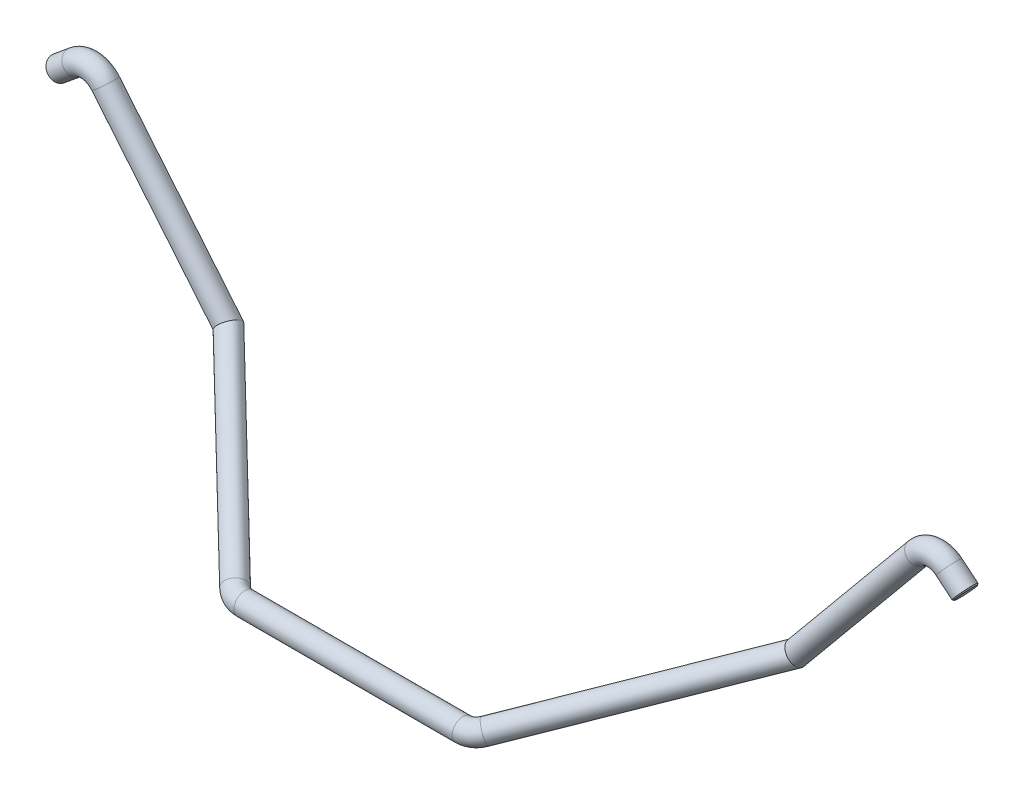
from build123d import *

# Parameters (mm, degrees)
ESQUISSE5_R     = 5
CHANFREIN1_SIZE = 0.5


with BuildPart() as part:
    # Base-Balayage: sweep along a curve in space
    with BuildLine() as base_balayage_path:
        Line((-208.0789353, 63.055507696, 0), (-200.371713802, 69.427221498, 0))
        ThreePointArc((-200.371713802, 69.427221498, 0), (-193.055653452, 71.675310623, 0), (-186.292778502, 68.091713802, 0))
        Line((-186.292778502, 68.091713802, 0), (-130, 0, 0))
        Line((-130, 0, 0), (-57.263808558, -32.487901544, 69.670529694))
        ThreePointArc((-57.263808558, -32.487901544, 69.670529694), (-53.954159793, -33.465036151, 71.766001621), (-50, -33.809460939, 72.504622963))
        Line((-50, -33.809460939, 72.504622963), (50, -33.809460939, 72.504622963))
        ThreePointArc((50, -33.809460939, 72.504622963), (53.954159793, -33.465036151, 71.766001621), (57.263808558, -32.487901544, 69.670529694))
        Line((57.263808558, -32.487901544, 69.670529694), (130, 0, 0))
        Line((130, 0, 0), (186.292778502, 68.091713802, 0))
        ThreePointArc((186.292778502, 68.091713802, 0), (193.055653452, 71.675310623, 0), (200.371713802, 69.427221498, 0))
        Line((200.371713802, 69.427221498, 0), (208.0789353, 63.055507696, 0))
    # Esquisse5 → Base-Balayage (sweep)
    with BuildSketch(Plane(origin=(208.0789353, 63.055507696, 0), x_dir=(0, 0, -1), z_dir=(0.77072214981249, -0.6371713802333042, 0))):
        Circle(ESQUISSE5_R)
    sweep(path=base_balayage_path.line, transition=Transition.RIGHT)

    # Chanfrein1
    chanfrein1_edges = [part.edges().sort_by_distance(p)[0] for p in [
        (-208.0789353, 63.055507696, 5),
        (208.0789353, 63.055507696, 5),
    ]]
    chamfer(chanfrein1_edges, length=CHANFREIN1_SIZE)


solid = part.part
